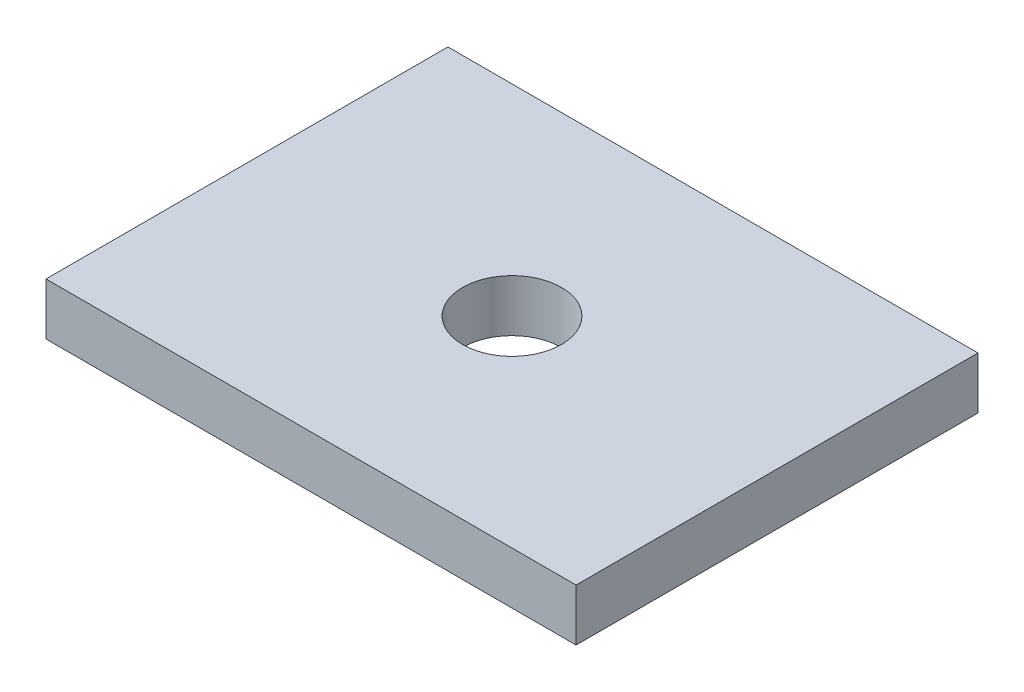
ISO-10303-21;
HEADER;
FILE_DESCRIPTION(('STEP AP214'),'2;1');
FILE_NAME('part.step','',(''),(''),'','','');
FILE_SCHEMA(('AUTOMOTIVE_DESIGN { 1 0 10303 214 1 1 1 1 }'));
ENDSEC;
DATA;
#1=APPLICATION_CONTEXT('core data for automotive mechanical design processes');
#2=APPLICATION_PROTOCOL_DEFINITION('international standard','automotive_design',2000,#1);
#3=PRODUCT_CONTEXT('',#1,'mechanical');
#4=PRODUCT('Part','Part','',(#3));
#5=PRODUCT_RELATED_PRODUCT_CATEGORY('part','',(#4));
#6=PRODUCT_DEFINITION_FORMATION('','',#4);
#7=PRODUCT_DEFINITION_CONTEXT('part definition',#1,'design');
#8=PRODUCT_DEFINITION('design','',#6,#7);
#9=PRODUCT_DEFINITION_SHAPE('','',#8);
#10=(LENGTH_UNIT() NAMED_UNIT(*) SI_UNIT(.MILLI.,.METRE.));
#11=(NAMED_UNIT(*) PLANE_ANGLE_UNIT() SI_UNIT($,.RADIAN.));
#12=(NAMED_UNIT(*) SI_UNIT($,.STERADIAN.) SOLID_ANGLE_UNIT());
#13=UNCERTAINTY_MEASURE_WITH_UNIT(LENGTH_MEASURE(1.E-05),#10,'distance_accuracy_value','');
#14=(GEOMETRIC_REPRESENTATION_CONTEXT(3) GLOBAL_UNCERTAINTY_ASSIGNED_CONTEXT((#13)) GLOBAL_UNIT_ASSIGNED_CONTEXT((#10,
#11,#12)) REPRESENTATION_CONTEXT('',''));
#15=CARTESIAN_POINT('',(0.,0.,0.));
#16=DIRECTION('',(0.,0.,1.));
#17=DIRECTION('',(1.,0.,0.));
#18=AXIS2_PLACEMENT_3D('',#15,#16,#17);
#19=CARTESIAN_POINT('',(50.9722290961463,10.,-38.6477759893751));
#20=DIRECTION('',(-1.,0.,0.));
#21=DIRECTION('',(0.,0.,1.));
#22=AXIS2_PLACEMENT_3D('',#19,#20,#21);
#23=PLANE('',#22);
#24=DIRECTION('',(0.,0.,-1.));
#25=VECTOR('',#24,1.);
#26=CARTESIAN_POINT('',(50.9722290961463,0.,-38.6477759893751));
#27=LINE('',#26,#25);
#28=CARTESIAN_POINT('',(50.9722290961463,0.,38.6477759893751));
#29=VERTEX_POINT('',#28);
#30=CARTESIAN_POINT('',(50.9722290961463,0.,-38.6477759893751));
#31=VERTEX_POINT('',#30);
#32=EDGE_CURVE('E96',#29,#31,#27,.T.);
#33=ORIENTED_EDGE('',*,*,#32,.T.);
#34=DIRECTION('',(0.,-1.,0.));
#35=VECTOR('',#34,1.);
#36=CARTESIAN_POINT('',(50.9722290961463,10.,-38.6477759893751));
#37=LINE('',#36,#35);
#38=CARTESIAN_POINT('',(50.9722290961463,10.,-38.6477759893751));
#39=VERTEX_POINT('',#38);
#40=EDGE_CURVE('E11',#39,#31,#37,.T.);
#41=ORIENTED_EDGE('',*,*,#40,.F.);
#42=DIRECTION('',(0.,0.,-1.));
#43=VECTOR('',#42,1.);
#44=CARTESIAN_POINT('',(50.9722290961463,10.,-38.6477759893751));
#45=LINE('',#44,#43);
#46=CARTESIAN_POINT('',(50.9722290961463,10.,38.6477759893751));
#47=VERTEX_POINT('',#46);
#48=EDGE_CURVE('E84',#47,#39,#45,.T.);
#49=ORIENTED_EDGE('',*,*,#48,.F.);
#50=DIRECTION('',(0.,-1.,0.));
#51=VECTOR('',#50,1.);
#52=CARTESIAN_POINT('',(50.9722290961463,10.,38.6477759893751));
#53=LINE('',#52,#51);
#54=EDGE_CURVE('E92',#47,#29,#53,.T.);
#55=ORIENTED_EDGE('',*,*,#54,.T.);
#56=EDGE_LOOP('',(#33,#41,#49,#55));
#57=FACE_BOUND('',#56,.T.);
#58=ADVANCED_FACE('F33',(#57),#23,.F.);
#59=CARTESIAN_POINT('',(-50.9722290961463,10.,-38.6477759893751));
#60=DIRECTION('',(0.,0.,1.));
#61=DIRECTION('',(1.,0.,0.));
#62=AXIS2_PLACEMENT_3D('',#59,#60,#61);
#63=PLANE('',#62);
#64=DIRECTION('',(-1.,0.,0.));
#65=VECTOR('',#64,1.);
#66=CARTESIAN_POINT('',(-50.9722290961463,0.,-38.6477759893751));
#67=LINE('',#66,#65);
#68=CARTESIAN_POINT('',(-50.9722290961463,0.,-38.6477759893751));
#69=VERTEX_POINT('',#68);
#70=EDGE_CURVE('E88',#31,#69,#67,.T.);
#71=ORIENTED_EDGE('',*,*,#70,.T.);
#72=DIRECTION('',(0.,-1.,0.));
#73=VECTOR('',#72,1.);
#74=CARTESIAN_POINT('',(-50.9722290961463,10.,-38.6477759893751));
#75=LINE('',#74,#73);
#76=CARTESIAN_POINT('',(-50.9722290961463,10.,-38.6477759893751));
#77=VERTEX_POINT('',#76);
#78=EDGE_CURVE('E41',#77,#69,#75,.T.);
#79=ORIENTED_EDGE('',*,*,#78,.F.);
#80=DIRECTION('',(-1.,0.,0.));
#81=VECTOR('',#80,1.);
#82=CARTESIAN_POINT('',(-50.9722290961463,10.,-38.6477759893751));
#83=LINE('',#82,#81);
#84=EDGE_CURVE('E79',#39,#77,#83,.T.);
#85=ORIENTED_EDGE('',*,*,#84,.F.);
#86=ORIENTED_EDGE('',*,*,#40,.T.);
#87=EDGE_LOOP('',(#71,#79,#85,#86));
#88=FACE_BOUND('',#87,.T.);
#89=ADVANCED_FACE('F87',(#88),#63,.F.);
#90=CARTESIAN_POINT('',(-50.9722290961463,10.,-38.6477759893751));
#91=DIRECTION('',(1.,0.,0.));
#92=DIRECTION('',(0.,0.,-1.));
#93=AXIS2_PLACEMENT_3D('',#90,#91,#92);
#94=PLANE('',#93);
#95=DIRECTION('',(0.,0.,1.));
#96=VECTOR('',#95,1.);
#97=CARTESIAN_POINT('',(-50.9722290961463,0.,-38.6477759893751));
#98=LINE('',#97,#96);
#99=CARTESIAN_POINT('',(-50.9722290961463,0.,38.6477759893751));
#100=VERTEX_POINT('',#99);
#101=EDGE_CURVE('E66',#69,#100,#98,.T.);
#102=ORIENTED_EDGE('',*,*,#101,.T.);
#103=DIRECTION('',(0.,-1.,0.));
#104=VECTOR('',#103,1.);
#105=CARTESIAN_POINT('',(-50.9722290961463,10.,38.6477759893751));
#106=LINE('',#105,#104);
#107=CARTESIAN_POINT('',(-50.9722290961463,10.,38.6477759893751));
#108=VERTEX_POINT('',#107);
#109=EDGE_CURVE('E89',#108,#100,#106,.T.);
#110=ORIENTED_EDGE('',*,*,#109,.F.);
#111=DIRECTION('',(0.,0.,1.));
#112=VECTOR('',#111,1.);
#113=CARTESIAN_POINT('',(-50.9722290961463,10.,-38.6477759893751));
#114=LINE('',#113,#112);
#115=EDGE_CURVE('E82',#77,#108,#114,.T.);
#116=ORIENTED_EDGE('',*,*,#115,.F.);
#117=ORIENTED_EDGE('',*,*,#78,.T.);
#118=EDGE_LOOP('',(#102,#110,#116,#117));
#119=FACE_BOUND('',#118,.T.);
#120=ADVANCED_FACE('F90',(#119),#94,.F.);
#121=CARTESIAN_POINT('',(-50.9722290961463,10.,38.6477759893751));
#122=DIRECTION('',(0.,0.,-1.));
#123=DIRECTION('',(-1.,0.,0.));
#124=AXIS2_PLACEMENT_3D('',#121,#122,#123);
#125=PLANE('',#124);
#126=DIRECTION('',(1.,0.,0.));
#127=VECTOR('',#126,1.);
#128=CARTESIAN_POINT('',(-50.9722290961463,0.,38.6477759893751));
#129=LINE('',#128,#127);
#130=EDGE_CURVE('E72',#100,#29,#129,.T.);
#131=ORIENTED_EDGE('',*,*,#130,.T.);
#132=ORIENTED_EDGE('',*,*,#54,.F.);
#133=DIRECTION('',(1.,0.,0.));
#134=VECTOR('',#133,1.);
#135=CARTESIAN_POINT('',(-50.9722290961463,10.,38.6477759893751));
#136=LINE('',#135,#134);
#137=EDGE_CURVE('E49',#108,#47,#136,.T.);
#138=ORIENTED_EDGE('',*,*,#137,.F.);
#139=ORIENTED_EDGE('',*,*,#109,.T.);
#140=EDGE_LOOP('',(#131,#132,#138,#139));
#141=FACE_BOUND('',#140,.T.);
#142=ADVANCED_FACE('F104',(#141),#125,.F.);
#143=CARTESIAN_POINT('',(50.9722290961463,10.,38.6477759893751));
#144=DIRECTION('',(0.,1.,0.));
#145=DIRECTION('',(0.,0.,1.));
#146=AXIS2_PLACEMENT_3D('',#143,#144,#145);
#147=PLANE('',#146);
#148=CARTESIAN_POINT('',(0.,10.,0.));
#149=DIRECTION('',(0.,1.,0.));
#150=DIRECTION('',(0.,0.,1.));
#151=AXIS2_PLACEMENT_3D('',#148,#149,#150);
#152=CIRCLE('',#151,9.51281869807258);
#153=CARTESIAN_POINT('',(0.,10.,9.51281869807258));
#154=VERTEX_POINT('',#153);
#155=EDGE_CURVE('E110',#154,#154,#152,.T.);
#156=ORIENTED_EDGE('',*,*,#155,.F.);
#157=EDGE_LOOP('',(#156));
#158=FACE_BOUND('',#157,.T.);
#159=ORIENTED_EDGE('',*,*,#48,.T.);
#160=ORIENTED_EDGE('',*,*,#84,.T.);
#161=ORIENTED_EDGE('',*,*,#115,.T.);
#162=ORIENTED_EDGE('',*,*,#137,.T.);
#163=EDGE_LOOP('',(#159,#160,#161,#162));
#164=FACE_BOUND('',#163,.T.);
#165=ADVANCED_FACE('F80',(#158,#164),#147,.T.);
#166=CARTESIAN_POINT('',(50.9722290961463,0.,38.6477759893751));
#167=DIRECTION('',(0.,1.,0.));
#168=DIRECTION('',(0.,0.,1.));
#169=AXIS2_PLACEMENT_3D('',#166,#167,#168);
#170=PLANE('',#169);
#171=CARTESIAN_POINT('',(0.,0.,0.));
#172=DIRECTION('',(0.,1.,0.));
#173=DIRECTION('',(0.,0.,1.));
#174=AXIS2_PLACEMENT_3D('',#171,#172,#173);
#175=CIRCLE('',#174,9.51281869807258);
#176=CARTESIAN_POINT('',(0.,0.,9.51281869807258));
#177=VERTEX_POINT('',#176);
#178=EDGE_CURVE('E99',#177,#177,#175,.T.);
#179=ORIENTED_EDGE('',*,*,#178,.T.);
#180=EDGE_LOOP('',(#179));
#181=FACE_BOUND('',#180,.T.);
#182=ORIENTED_EDGE('',*,*,#32,.F.);
#183=ORIENTED_EDGE('',*,*,#130,.F.);
#184=ORIENTED_EDGE('',*,*,#101,.F.);
#185=ORIENTED_EDGE('',*,*,#70,.F.);
#186=EDGE_LOOP('',(#182,#183,#184,#185));
#187=FACE_BOUND('',#186,.T.);
#188=ADVANCED_FACE('F107',(#181,#187),#170,.F.);
#189=CARTESIAN_POINT('',(0.,0.,0.));
#190=DIRECTION('',(0.,1.,0.));
#191=DIRECTION('',(0.,0.,1.));
#192=AXIS2_PLACEMENT_3D('',#189,#190,#191);
#193=CYLINDRICAL_SURFACE('',#192,9.51281869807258);
#194=ORIENTED_EDGE('',*,*,#178,.F.);
#195=EDGE_LOOP('',(#194));
#196=FACE_BOUND('',#195,.T.);
#197=ORIENTED_EDGE('',*,*,#155,.T.);
#198=EDGE_LOOP('',(#197));
#199=FACE_BOUND('',#198,.T.);
#200=ADVANCED_FACE('F117',(#196,#199),#193,.F.);
#201=CLOSED_SHELL('',(#58,#89,#120,#142,#165,#188,#200));
#202=MANIFOLD_SOLID_BREP('B2',#201);
#203=ADVANCED_BREP_SHAPE_REPRESENTATION('',(#18,#202),#14);
#204=SHAPE_DEFINITION_REPRESENTATION(#9,#203);
ENDSEC;
END-ISO-10303-21;
